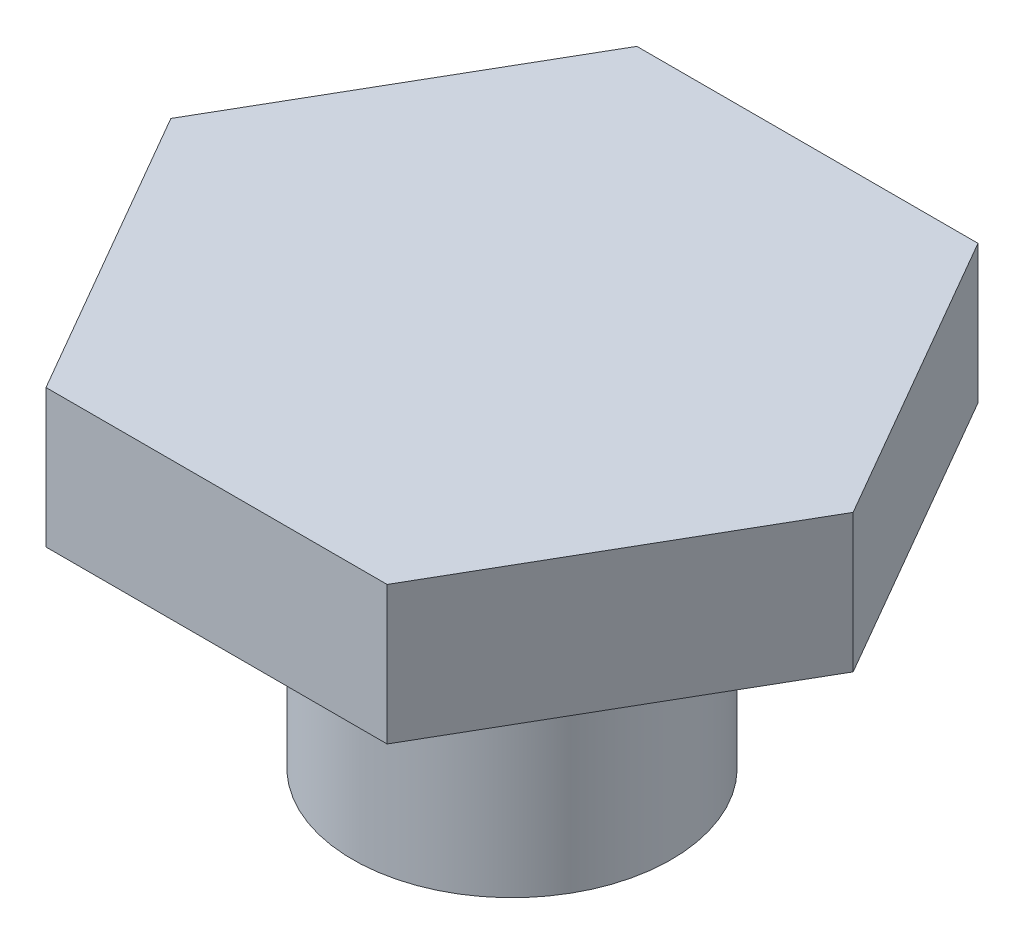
ISO-10303-21;
HEADER;
FILE_DESCRIPTION(('STEP AP214'),'2;1');
FILE_NAME('part.step','',(''),(''),'','','');
FILE_SCHEMA(('AUTOMOTIVE_DESIGN { 1 0 10303 214 1 1 1 1 }'));
ENDSEC;
DATA;
#1=APPLICATION_CONTEXT('core data for automotive mechanical design processes');
#2=APPLICATION_PROTOCOL_DEFINITION('international standard','automotive_design',2000,#1);
#3=PRODUCT_CONTEXT('',#1,'mechanical');
#4=PRODUCT('Part','Part','',(#3));
#5=PRODUCT_RELATED_PRODUCT_CATEGORY('part','',(#4));
#6=PRODUCT_DEFINITION_FORMATION('','',#4);
#7=PRODUCT_DEFINITION_CONTEXT('part definition',#1,'design');
#8=PRODUCT_DEFINITION('design','',#6,#7);
#9=PRODUCT_DEFINITION_SHAPE('','',#8);
#10=(LENGTH_UNIT() NAMED_UNIT(*) SI_UNIT(.MILLI.,.METRE.));
#11=(NAMED_UNIT(*) PLANE_ANGLE_UNIT() SI_UNIT($,.RADIAN.));
#12=(NAMED_UNIT(*) SI_UNIT($,.STERADIAN.) SOLID_ANGLE_UNIT());
#13=UNCERTAINTY_MEASURE_WITH_UNIT(LENGTH_MEASURE(1.E-05),#10,'distance_accuracy_value','');
#14=(GEOMETRIC_REPRESENTATION_CONTEXT(3) GLOBAL_UNCERTAINTY_ASSIGNED_CONTEXT((#13)) GLOBAL_UNIT_ASSIGNED_CONTEXT((#10,
#11,#12)) REPRESENTATION_CONTEXT('',''));
#15=CARTESIAN_POINT('',(0.,0.,0.));
#16=DIRECTION('',(0.,0.,1.));
#17=DIRECTION('',(1.,0.,0.));
#18=AXIS2_PLACEMENT_3D('',#15,#16,#17);
#19=CARTESIAN_POINT('',(0.,-1.22839378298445,0.));
#20=DIRECTION('',(0.,-1.,0.));
#21=DIRECTION('',(0.,0.,-1.));
#22=AXIS2_PLACEMENT_3D('',#19,#20,#21);
#23=CONICAL_SURFACE('',#22,5.5626,1.04719755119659);
#24=CARTESIAN_POINT('',(0.,-0.685799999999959,0.));
#25=DIRECTION('',(0.,-1.,0.));
#26=DIRECTION('',(0.,0.,-1.));
#27=AXIS2_PLACEMENT_3D('',#24,#25,#26);
#28=CIRCLE('',#27,4.6228);
#29=CARTESIAN_POINT('',(0.,-0.685799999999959,-4.6228));
#30=VERTEX_POINT('',#29);
#31=EDGE_CURVE('E127',#30,#30,#28,.T.);
#32=ORIENTED_EDGE('',*,*,#31,.T.);
#33=EDGE_LOOP('',(#32));
#34=FACE_BOUND('',#33,.T.);
#35=CARTESIAN_POINT('',(0.,-1.22839378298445,0.));
#36=DIRECTION('',(0.,-1.,0.));
#37=DIRECTION('',(0.,0.,-1.));
#38=AXIS2_PLACEMENT_3D('',#35,#36,#37);
#39=CIRCLE('',#38,5.5626);
#40=CARTESIAN_POINT('',(0.,-1.22839378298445,-5.5626));
#41=VERTEX_POINT('',#40);
#42=EDGE_CURVE('E11',#41,#41,#39,.T.);
#43=ORIENTED_EDGE('',*,*,#42,.F.);
#44=EDGE_LOOP('',(#43));
#45=FACE_BOUND('',#44,.T.);
#46=ADVANCED_FACE('F36',(#34,#45),#23,.T.);
#47=CARTESIAN_POINT('',(0.,0.,0.));
#48=DIRECTION('',(0.,-1.,0.));
#49=DIRECTION('',(0.,0.,-1.));
#50=AXIS2_PLACEMENT_3D('',#47,#48,#49);
#51=CYLINDRICAL_SURFACE('',#50,5.5626);
#52=ORIENTED_EDGE('',*,*,#42,.T.);
#53=EDGE_LOOP('',(#52));
#54=FACE_BOUND('',#53,.T.);
#55=CARTESIAN_POINT('',(0.,-7.05200621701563,0.));
#56=DIRECTION('',(0.,-1.,0.));
#57=DIRECTION('',(0.,0.,-1.));
#58=AXIS2_PLACEMENT_3D('',#55,#56,#57);
#59=CIRCLE('',#58,5.5626);
#60=CARTESIAN_POINT('',(0.,-7.05200621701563,-5.5626));
#61=VERTEX_POINT('',#60);
#62=EDGE_CURVE('E43',#61,#61,#59,.T.);
#63=ORIENTED_EDGE('',*,*,#62,.F.);
#64=EDGE_LOOP('',(#63));
#65=FACE_BOUND('',#64,.T.);
#66=ADVANCED_FACE('F154',(#54,#65),#51,.T.);
#67=CARTESIAN_POINT('',(0.,-7.59460000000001,0.));
#68=DIRECTION('',(0.,1.,0.));
#69=DIRECTION('',(0.,0.,1.));
#70=AXIS2_PLACEMENT_3D('',#67,#68,#69);
#71=CONICAL_SURFACE('',#70,4.6228,1.0471975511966);
#72=ORIENTED_EDGE('',*,*,#62,.T.);
#73=EDGE_LOOP('',(#72));
#74=FACE_BOUND('',#73,.T.);
#75=CARTESIAN_POINT('',(0.,-7.59460000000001,0.));
#76=DIRECTION('',(0.,-1.,0.));
#77=DIRECTION('',(0.,0.,-1.));
#78=AXIS2_PLACEMENT_3D('',#75,#76,#77);
#79=CIRCLE('',#78,4.6228);
#80=CARTESIAN_POINT('',(0.,-7.59460000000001,-4.6228));
#81=VERTEX_POINT('',#80);
#82=EDGE_CURVE('E146',#81,#81,#79,.T.);
#83=ORIENTED_EDGE('',*,*,#82,.F.);
#84=EDGE_LOOP('',(#83));
#85=FACE_BOUND('',#84,.T.);
#86=ADVANCED_FACE('F151',(#74,#85),#71,.T.);
#87=CARTESIAN_POINT('',(0.,-7.59460000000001,0.));
#88=DIRECTION('',(0.,-1.,0.));
#89=DIRECTION('',(0.,0.,-1.));
#90=AXIS2_PLACEMENT_3D('',#87,#88,#89);
#91=PLANE('',#90);
#92=ORIENTED_EDGE('',*,*,#82,.T.);
#93=EDGE_LOOP('',(#92));
#94=FACE_BOUND('',#93,.T.);
#95=ADVANCED_FACE('F161',(#94),#91,.T.);
#96=CARTESIAN_POINT('',(9.5631,1.80340000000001,0.));
#97=DIRECTION('',(0.,-1.,0.));
#98=DIRECTION('',(0.,0.,-1.));
#99=AXIS2_PLACEMENT_3D('',#96,#97,#98);
#100=PLANE('',#99);
#101=DIRECTION('',(-0.5,0.,-0.866025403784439));
#102=VECTOR('',#101,1.);
#103=CARTESIAN_POINT('',(-5.95753309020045,1.80340000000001,10.31875));
#104=LINE('',#103,#102);
#105=CARTESIAN_POINT('',(-5.95753309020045,1.80340000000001,10.31875));
#106=VERTEX_POINT('',#105);
#107=CARTESIAN_POINT('',(-11.9150661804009,1.80340000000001,0.));
#108=VERTEX_POINT('',#107);
#109=EDGE_CURVE('E113',#106,#108,#104,.T.);
#110=ORIENTED_EDGE('',*,*,#109,.T.);
#111=DIRECTION('',(0.5,0.,-0.866025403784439));
#112=VECTOR('',#111,1.);
#113=CARTESIAN_POINT('',(-11.9150661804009,1.80340000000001,0.));
#114=LINE('',#113,#112);
#115=CARTESIAN_POINT('',(-5.95753309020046,1.80340000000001,-10.31875));
#116=VERTEX_POINT('',#115);
#117=EDGE_CURVE('E131',#108,#116,#114,.T.);
#118=ORIENTED_EDGE('',*,*,#117,.T.);
#119=DIRECTION('',(1.,0.,0.));
#120=VECTOR('',#119,1.);
#121=CARTESIAN_POINT('',(-5.95753309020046,1.80340000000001,-10.31875));
#122=LINE('',#121,#120);
#123=CARTESIAN_POINT('',(5.95753309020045,1.80340000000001,-10.31875));
#124=VERTEX_POINT('',#123);
#125=EDGE_CURVE('E124',#116,#124,#122,.T.);
#126=ORIENTED_EDGE('',*,*,#125,.T.);
#127=DIRECTION('',(0.5,0.,0.866025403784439));
#128=VECTOR('',#127,1.);
#129=CARTESIAN_POINT('',(5.95753309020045,1.80340000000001,-10.31875));
#130=LINE('',#129,#128);
#131=CARTESIAN_POINT('',(11.9150661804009,1.80340000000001,0.));
#132=VERTEX_POINT('',#131);
#133=EDGE_CURVE('E327',#124,#132,#130,.T.);
#134=ORIENTED_EDGE('',*,*,#133,.T.);
#135=DIRECTION('',(-0.5,0.,0.866025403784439));
#136=VECTOR('',#135,1.);
#137=CARTESIAN_POINT('',(11.9150661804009,1.80340000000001,0.));
#138=LINE('',#137,#136);
#139=CARTESIAN_POINT('',(5.95753309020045,1.80340000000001,10.31875));
#140=VERTEX_POINT('',#139);
#141=EDGE_CURVE('E331',#132,#140,#138,.T.);
#142=ORIENTED_EDGE('',*,*,#141,.T.);
#143=DIRECTION('',(-1.,0.,0.));
#144=VECTOR('',#143,1.);
#145=CARTESIAN_POINT('',(5.95753309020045,1.80340000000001,10.31875));
#146=LINE('',#145,#144);
#147=EDGE_CURVE('E339',#140,#106,#146,.T.);
#148=ORIENTED_EDGE('',*,*,#147,.T.);
#149=EDGE_LOOP('',(#110,#118,#126,#134,#142,#148));
#150=FACE_BOUND('',#149,.T.);
#151=CARTESIAN_POINT('',(0.,1.80340000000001,0.));
#152=DIRECTION('',(0.,-1.,0.));
#153=DIRECTION('',(0.,0.,-1.));
#154=AXIS2_PLACEMENT_3D('',#151,#152,#153);
#155=CIRCLE('',#154,9.5631);
#156=CARTESIAN_POINT('',(0.,1.80340000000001,-9.5631));
#157=VERTEX_POINT('',#156);
#158=EDGE_CURVE('E143',#157,#157,#155,.T.);
#159=ORIENTED_EDGE('',*,*,#158,.F.);
#160=EDGE_LOOP('',(#159));
#161=FACE_BOUND('',#160,.T.);
#162=ADVANCED_FACE('F167',(#150,#161),#100,.T.);
#163=CARTESIAN_POINT('',(0.,0.,0.));
#164=DIRECTION('',(0.,-1.,0.));
#165=DIRECTION('',(0.,0.,-1.));
#166=AXIS2_PLACEMENT_3D('',#163,#164,#165);
#167=CYLINDRICAL_SURFACE('',#166,9.5631);
#168=ORIENTED_EDGE('',*,*,#158,.T.);
#169=EDGE_LOOP('',(#168));
#170=FACE_BOUND('',#169,.T.);
#171=CARTESIAN_POINT('',(0.,2.81940000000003,0.));
#172=DIRECTION('',(0.,-1.,0.));
#173=DIRECTION('',(0.,0.,-1.));
#174=AXIS2_PLACEMENT_3D('',#171,#172,#173);
#175=CIRCLE('',#174,9.5631);
#176=CARTESIAN_POINT('',(0.,2.81940000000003,-9.5631));
#177=VERTEX_POINT('',#176);
#178=EDGE_CURVE('E140',#177,#177,#175,.T.);
#179=ORIENTED_EDGE('',*,*,#178,.F.);
#180=EDGE_LOOP('',(#179));
#181=FACE_BOUND('',#180,.T.);
#182=ADVANCED_FACE('F174',(#170,#181),#167,.F.);
#183=CARTESIAN_POINT('',(6.9977,2.81940000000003,0.));
#184=DIRECTION('',(0.,-1.,0.));
#185=DIRECTION('',(0.,0.,-1.));
#186=AXIS2_PLACEMENT_3D('',#183,#184,#185);
#187=PLANE('',#186);
#188=ORIENTED_EDGE('',*,*,#178,.T.);
#189=EDGE_LOOP('',(#188));
#190=FACE_BOUND('',#189,.T.);
#191=CARTESIAN_POINT('',(0.,2.81940000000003,0.));
#192=DIRECTION('',(0.,-1.,0.));
#193=DIRECTION('',(0.,0.,-1.));
#194=AXIS2_PLACEMENT_3D('',#191,#192,#193);
#195=CIRCLE('',#194,6.9977);
#196=CARTESIAN_POINT('',(0.,2.81940000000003,-6.9977));
#197=VERTEX_POINT('',#196);
#198=EDGE_CURVE('E137',#197,#197,#195,.T.);
#199=ORIENTED_EDGE('',*,*,#198,.F.);
#200=EDGE_LOOP('',(#199));
#201=FACE_BOUND('',#200,.T.);
#202=ADVANCED_FACE('F178',(#190,#201),#187,.T.);
#203=CARTESIAN_POINT('',(0.,0.,0.));
#204=DIRECTION('',(0.,-1.,0.));
#205=DIRECTION('',(0.,0.,-1.));
#206=AXIS2_PLACEMENT_3D('',#203,#204,#205);
#207=CYLINDRICAL_SURFACE('',#206,6.9977);
#208=ORIENTED_EDGE('',*,*,#198,.T.);
#209=EDGE_LOOP('',(#208));
#210=FACE_BOUND('',#209,.T.);
#211=CARTESIAN_POINT('',(0.,1.54940000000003,0.));
#212=DIRECTION('',(0.,-1.,0.));
#213=DIRECTION('',(0.,0.,-1.));
#214=AXIS2_PLACEMENT_3D('',#211,#212,#213);
#215=CIRCLE('',#214,6.9977);
#216=CARTESIAN_POINT('',(0.,1.54940000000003,-6.9977));
#217=VERTEX_POINT('',#216);
#218=EDGE_CURVE('E134',#217,#217,#215,.T.);
#219=ORIENTED_EDGE('',*,*,#218,.F.);
#220=EDGE_LOOP('',(#219));
#221=FACE_BOUND('',#220,.T.);
#222=ADVANCED_FACE('F182',(#210,#221),#207,.T.);
#223=CARTESIAN_POINT('',(4.6228,1.54940000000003,0.));
#224=DIRECTION('',(0.,-1.,0.));
#225=DIRECTION('',(0.,0.,-1.));
#226=AXIS2_PLACEMENT_3D('',#223,#224,#225);
#227=PLANE('',#226);
#228=ORIENTED_EDGE('',*,*,#218,.T.);
#229=EDGE_LOOP('',(#228));
#230=FACE_BOUND('',#229,.T.);
#231=CARTESIAN_POINT('',(0.,1.54940000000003,0.));
#232=DIRECTION('',(0.,-1.,0.));
#233=DIRECTION('',(0.,0.,-1.));
#234=AXIS2_PLACEMENT_3D('',#231,#232,#233);
#235=CIRCLE('',#234,4.6228);
#236=CARTESIAN_POINT('',(0.,1.54940000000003,-4.6228));
#237=VERTEX_POINT('',#236);
#238=EDGE_CURVE('E130',#237,#237,#235,.T.);
#239=ORIENTED_EDGE('',*,*,#238,.F.);
#240=EDGE_LOOP('',(#239));
#241=FACE_BOUND('',#240,.T.);
#242=ADVANCED_FACE('F186',(#230,#241),#227,.T.);
#243=CARTESIAN_POINT('',(0.,0.,0.));
#244=DIRECTION('',(0.,-1.,0.));
#245=DIRECTION('',(0.,0.,-1.));
#246=AXIS2_PLACEMENT_3D('',#243,#244,#245);
#247=CYLINDRICAL_SURFACE('',#246,4.6228);
#248=ORIENTED_EDGE('',*,*,#238,.T.);
#249=EDGE_LOOP('',(#248));
#250=FACE_BOUND('',#249,.T.);
#251=ORIENTED_EDGE('',*,*,#31,.F.);
#252=EDGE_LOOP('',(#251));
#253=FACE_BOUND('',#252,.T.);
#254=ADVANCED_FACE('F190',(#250,#253),#247,.T.);
#255=CARTESIAN_POINT('',(-5.95753309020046,38.1537019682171,-10.31875));
#256=DIRECTION('',(0.,0.,-1.));
#257=DIRECTION('',(-1.,0.,0.));
#258=AXIS2_PLACEMENT_3D('',#255,#256,#257);
#259=PLANE('',#258);
#260=DIRECTION('',(1.,0.,0.));
#261=VECTOR('',#260,1.);
#262=CARTESIAN_POINT('',(-5.95753309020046,6.62940000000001,-10.31875));
#263=LINE('',#262,#261);
#264=CARTESIAN_POINT('',(-5.95753309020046,6.62940000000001,-10.31875));
#265=VERTEX_POINT('',#264);
#266=CARTESIAN_POINT('',(5.95753309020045,6.62940000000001,-10.31875));
#267=VERTEX_POINT('',#266);
#268=EDGE_CURVE('E50',#265,#267,#263,.T.);
#269=ORIENTED_EDGE('',*,*,#268,.T.);
#270=DIRECTION('',(0.,-1.,0.));
#271=VECTOR('',#270,1.);
#272=CARTESIAN_POINT('',(5.95753309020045,38.1537019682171,-10.31875));
#273=LINE('',#272,#271);
#274=EDGE_CURVE('E125',#267,#124,#273,.T.);
#275=ORIENTED_EDGE('',*,*,#274,.T.);
#276=ORIENTED_EDGE('',*,*,#125,.F.);
#277=DIRECTION('',(0.,-1.,0.));
#278=VECTOR('',#277,1.);
#279=CARTESIAN_POINT('',(-5.95753309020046,38.1537019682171,-10.31875));
#280=LINE('',#279,#278);
#281=EDGE_CURVE('E109',#265,#116,#280,.T.);
#282=ORIENTED_EDGE('',*,*,#281,.F.);
#283=EDGE_LOOP('',(#269,#275,#276,#282));
#284=FACE_BOUND('',#283,.T.);
#285=ADVANCED_FACE('F194',(#284),#259,.T.);
#286=CARTESIAN_POINT('',(-11.9150661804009,38.1537019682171,0.));
#287=DIRECTION('',(-0.866025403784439,0.,-0.5));
#288=DIRECTION('',(-0.5,0.,0.866025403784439));
#289=AXIS2_PLACEMENT_3D('',#286,#287,#288);
#290=PLANE('',#289);
#291=DIRECTION('',(0.5,0.,-0.866025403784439));
#292=VECTOR('',#291,1.);
#293=CARTESIAN_POINT('',(-11.9150661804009,6.62940000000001,0.));
#294=LINE('',#293,#292);
#295=CARTESIAN_POINT('',(-11.9150661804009,6.62940000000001,0.));
#296=VERTEX_POINT('',#295);
#297=EDGE_CURVE('E105',#296,#265,#294,.T.);
#298=ORIENTED_EDGE('',*,*,#297,.T.);
#299=ORIENTED_EDGE('',*,*,#281,.T.);
#300=ORIENTED_EDGE('',*,*,#117,.F.);
#301=DIRECTION('',(0.,-1.,0.));
#302=VECTOR('',#301,1.);
#303=CARTESIAN_POINT('',(-11.9150661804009,38.1537019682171,0.));
#304=LINE('',#303,#302);
#305=EDGE_CURVE('E100',#296,#108,#304,.T.);
#306=ORIENTED_EDGE('',*,*,#305,.F.);
#307=EDGE_LOOP('',(#298,#299,#300,#306));
#308=FACE_BOUND('',#307,.T.);
#309=ADVANCED_FACE('F198',(#308),#290,.T.);
#310=CARTESIAN_POINT('',(-5.95753309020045,38.1537019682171,10.31875));
#311=DIRECTION('',(-0.866025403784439,0.,0.5));
#312=DIRECTION('',(0.5,0.,0.866025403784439));
#313=AXIS2_PLACEMENT_3D('',#310,#311,#312);
#314=PLANE('',#313);
#315=DIRECTION('',(-0.5,0.,-0.866025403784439));
#316=VECTOR('',#315,1.);
#317=CARTESIAN_POINT('',(-5.95753309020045,6.62940000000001,10.31875));
#318=LINE('',#317,#316);
#319=CARTESIAN_POINT('',(-5.95753309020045,6.62940000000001,10.31875));
#320=VERTEX_POINT('',#319);
#321=EDGE_CURVE('E103',#320,#296,#318,.T.);
#322=ORIENTED_EDGE('',*,*,#321,.T.);
#323=ORIENTED_EDGE('',*,*,#305,.T.);
#324=ORIENTED_EDGE('',*,*,#109,.F.);
#325=DIRECTION('',(0.,-1.,0.));
#326=VECTOR('',#325,1.);
#327=CARTESIAN_POINT('',(-5.95753309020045,38.1537019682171,10.31875));
#328=LINE('',#327,#326);
#329=EDGE_CURVE('E96',#320,#106,#328,.T.);
#330=ORIENTED_EDGE('',*,*,#329,.F.);
#331=EDGE_LOOP('',(#322,#323,#324,#330));
#332=FACE_BOUND('',#331,.T.);
#333=ADVANCED_FACE('F111',(#332),#314,.T.);
#334=CARTESIAN_POINT('',(5.95753309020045,38.1537019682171,10.31875));
#335=DIRECTION('',(0.,0.,1.));
#336=DIRECTION('',(1.,0.,0.));
#337=AXIS2_PLACEMENT_3D('',#334,#335,#336);
#338=PLANE('',#337);
#339=DIRECTION('',(-1.,0.,0.));
#340=VECTOR('',#339,1.);
#341=CARTESIAN_POINT('',(5.95753309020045,6.62940000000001,10.31875));
#342=LINE('',#341,#340);
#343=CARTESIAN_POINT('',(5.95753309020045,6.62940000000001,10.31875));
#344=VERTEX_POINT('',#343);
#345=EDGE_CURVE('E92',#344,#320,#342,.T.);
#346=ORIENTED_EDGE('',*,*,#345,.T.);
#347=ORIENTED_EDGE('',*,*,#329,.T.);
#348=ORIENTED_EDGE('',*,*,#147,.F.);
#349=DIRECTION('',(0.,-1.,0.));
#350=VECTOR('',#349,1.);
#351=CARTESIAN_POINT('',(5.95753309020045,38.1537019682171,10.31875));
#352=LINE('',#351,#350);
#353=EDGE_CURVE('E98',#344,#140,#352,.T.);
#354=ORIENTED_EDGE('',*,*,#353,.F.);
#355=EDGE_LOOP('',(#346,#347,#348,#354));
#356=FACE_BOUND('',#355,.T.);
#357=ADVANCED_FACE('F94',(#356),#338,.T.);
#358=CARTESIAN_POINT('',(11.9150661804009,38.1537019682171,0.));
#359=DIRECTION('',(0.866025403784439,0.,0.5));
#360=DIRECTION('',(0.5,0.,-0.866025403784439));
#361=AXIS2_PLACEMENT_3D('',#358,#359,#360);
#362=PLANE('',#361);
#363=DIRECTION('',(-0.5,0.,0.866025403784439));
#364=VECTOR('',#363,1.);
#365=CARTESIAN_POINT('',(11.9150661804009,6.62940000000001,0.));
#366=LINE('',#365,#364);
#367=CARTESIAN_POINT('',(11.9150661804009,6.62940000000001,0.));
#368=VERTEX_POINT('',#367);
#369=EDGE_CURVE('E115',#368,#344,#366,.T.);
#370=ORIENTED_EDGE('',*,*,#369,.T.);
#371=ORIENTED_EDGE('',*,*,#353,.T.);
#372=ORIENTED_EDGE('',*,*,#141,.F.);
#373=DIRECTION('',(0.,-1.,0.));
#374=VECTOR('',#373,1.);
#375=CARTESIAN_POINT('',(11.9150661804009,38.1537019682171,0.));
#376=LINE('',#375,#374);
#377=EDGE_CURVE('E122',#368,#132,#376,.T.);
#378=ORIENTED_EDGE('',*,*,#377,.F.);
#379=EDGE_LOOP('',(#370,#371,#372,#378));
#380=FACE_BOUND('',#379,.T.);
#381=ADVANCED_FACE('F206',(#380),#362,.T.);
#382=CARTESIAN_POINT('',(5.95753309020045,38.1537019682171,-10.31875));
#383=DIRECTION('',(0.866025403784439,0.,-0.5));
#384=DIRECTION('',(-0.5,0.,-0.866025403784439));
#385=AXIS2_PLACEMENT_3D('',#382,#383,#384);
#386=PLANE('',#385);
#387=DIRECTION('',(0.5,0.,0.866025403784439));
#388=VECTOR('',#387,1.);
#389=CARTESIAN_POINT('',(5.95753309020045,6.62940000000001,-10.31875));
#390=LINE('',#389,#388);
#391=EDGE_CURVE('E58',#267,#368,#390,.T.);
#392=ORIENTED_EDGE('',*,*,#391,.T.);
#393=ORIENTED_EDGE('',*,*,#377,.T.);
#394=ORIENTED_EDGE('',*,*,#133,.F.);
#395=ORIENTED_EDGE('',*,*,#274,.F.);
#396=EDGE_LOOP('',(#392,#393,#394,#395));
#397=FACE_BOUND('',#396,.T.);
#398=ADVANCED_FACE('F171',(#397),#386,.T.);
#399=CARTESIAN_POINT('',(10.31875,6.62940000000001,0.));
#400=DIRECTION('',(0.,1.,0.));
#401=DIRECTION('',(0.,0.,1.));
#402=AXIS2_PLACEMENT_3D('',#399,#400,#401);
#403=PLANE('',#402);
#404=ORIENTED_EDGE('',*,*,#369,.F.);
#405=ORIENTED_EDGE('',*,*,#391,.F.);
#406=ORIENTED_EDGE('',*,*,#268,.F.);
#407=ORIENTED_EDGE('',*,*,#297,.F.);
#408=ORIENTED_EDGE('',*,*,#321,.F.);
#409=ORIENTED_EDGE('',*,*,#345,.F.);
#410=EDGE_LOOP('',(#404,#405,#406,#407,#408,#409));
#411=FACE_BOUND('',#410,.T.);
#412=ADVANCED_FACE('F104',(#411),#403,.T.);
#413=CLOSED_SHELL('',(#46,#66,#86,#95,#162,#182,#202,#222,#242,#254,#285,#309,#333,#357,#381,
#398,#412));
#414=MANIFOLD_SOLID_BREP('B2',#413);
#415=ADVANCED_BREP_SHAPE_REPRESENTATION('',(#18,#414),#14);
#416=SHAPE_DEFINITION_REPRESENTATION(#9,#415);
ENDSEC;
END-ISO-10303-21;
